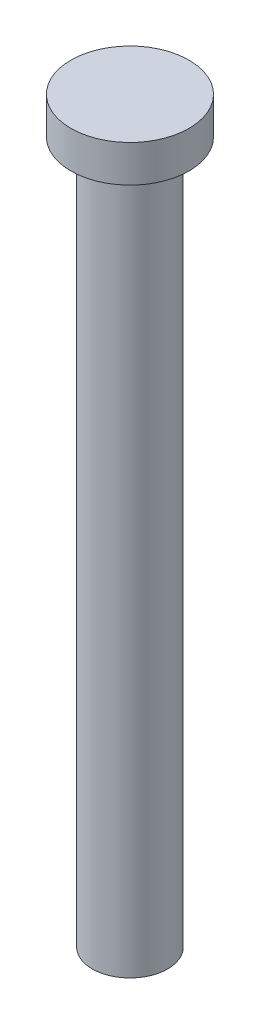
from build123d import *

# Parameters (mm, degrees)
PINDIA_R            = 5.1
LENGTH_DEPTH        = 100
HEADDIA_R           = 8
HEADTHICKNESS_DEPTH = 5
FILLET1_R           = 0.5


with BuildPart() as part:
    # PinDia → Length (new body)
    with BuildSketch(Plane(origin=(0, 0, 0), x_dir=(1, 0, 0), z_dir=(0, 1, 0))):
        with Locations(Location((0, 0, 0), (0, 0, 270))):
            Circle(PINDIA_R)
    extrude(amount=-LENGTH_DEPTH)

    # HeadDia → HeadThickness (add)
    with BuildSketch(Plane(origin=(0, 0, 0), x_dir=(1, 0, 0), z_dir=(0, 1, 0))):
        with Locations(Location((0, 0, 0), (0, 0, 270))):
            Circle(HEADDIA_R)
    extrude(amount=-HEADTHICKNESS_DEPTH)

    # Fillet1
    fillet1_edges = [part.edges().sort_by_distance(p)[0] for p in [
        (0, -5, -5.1),
    ]]
    fillet(fillet1_edges, radius=FILLET1_R)


solid = part.part
